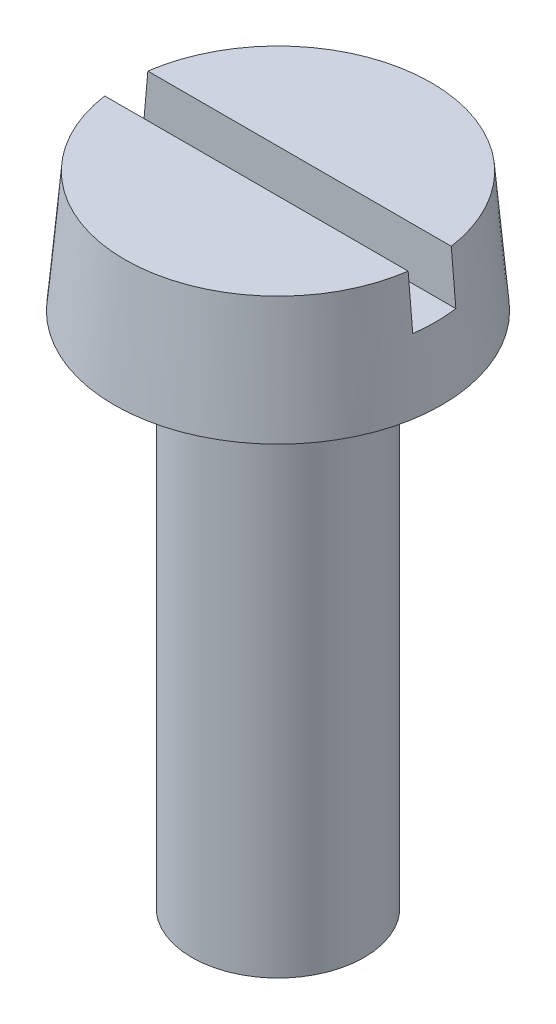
ISO-10303-21;
HEADER;
FILE_DESCRIPTION(('STEP AP214'),'2;1');
FILE_NAME('part.step','',(''),(''),'','','');
FILE_SCHEMA(('AUTOMOTIVE_DESIGN { 1 0 10303 214 1 1 1 1 }'));
ENDSEC;
DATA;
#1=APPLICATION_CONTEXT('core data for automotive mechanical design processes');
#2=APPLICATION_PROTOCOL_DEFINITION('international standard','automotive_design',2000,#1);
#3=PRODUCT_CONTEXT('',#1,'mechanical');
#4=PRODUCT('Part','Part','',(#3));
#5=PRODUCT_RELATED_PRODUCT_CATEGORY('part','',(#4));
#6=PRODUCT_DEFINITION_FORMATION('','',#4);
#7=PRODUCT_DEFINITION_CONTEXT('part definition',#1,'design');
#8=PRODUCT_DEFINITION('design','',#6,#7);
#9=PRODUCT_DEFINITION_SHAPE('','',#8);
#10=(LENGTH_UNIT() NAMED_UNIT(*) SI_UNIT(.MILLI.,.METRE.));
#11=(NAMED_UNIT(*) PLANE_ANGLE_UNIT() SI_UNIT($,.RADIAN.));
#12=(NAMED_UNIT(*) SI_UNIT($,.STERADIAN.) SOLID_ANGLE_UNIT());
#13=UNCERTAINTY_MEASURE_WITH_UNIT(LENGTH_MEASURE(1.E-05),#10,'distance_accuracy_value','');
#14=(GEOMETRIC_REPRESENTATION_CONTEXT(3) GLOBAL_UNCERTAINTY_ASSIGNED_CONTEXT((#13)) GLOBAL_UNIT_ASSIGNED_CONTEXT((#10,
#11,#12)) REPRESENTATION_CONTEXT('',''));
#15=CARTESIAN_POINT('',(0.,0.,0.));
#16=DIRECTION('',(0.,0.,1.));
#17=DIRECTION('',(1.,0.,0.));
#18=AXIS2_PLACEMENT_3D('',#15,#16,#17);
#19=CARTESIAN_POINT('',(2.28,0.800000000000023,0.249999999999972));
#20=DIRECTION('',(0.,-1.,0.));
#21=DIRECTION('',(1.,0.,0.));
#22=AXIS2_PLACEMENT_3D('',#19,#20,#21);
#23=PLANE('',#22);
#24=CARTESIAN_POINT('',(0.,0.800000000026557,0.));
#25=DIRECTION('',(0.,-1.,0.));
#26=DIRECTION('',(1.,0.,0.));
#27=AXIS2_PLACEMENT_3D('',#24,#25,#26);
#28=CIRCLE('',#27,1.83000906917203);
#29=CARTESIAN_POINT('',(-1.81285222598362,0.800000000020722,0.249999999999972));
#30=VERTEX_POINT('',#29);
#31=CARTESIAN_POINT('',(-1.81285222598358,0.800000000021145,-0.249999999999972));
#32=VERTEX_POINT('',#31);
#33=EDGE_CURVE('E70',#30,#32,#28,.T.);
#34=ORIENTED_EDGE('',*,*,#33,.F.);
#35=DIRECTION('',(1.,0.,0.));
#36=VECTOR('',#35,1.);
#37=CARTESIAN_POINT('',(2.28,0.800000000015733,0.249999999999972));
#38=LINE('',#37,#36);
#39=CARTESIAN_POINT('',(1.81285222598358,0.800000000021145,0.249999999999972));
#40=VERTEX_POINT('',#39);
#41=EDGE_CURVE('E68',#30,#40,#38,.T.);
#42=ORIENTED_EDGE('',*,*,#41,.T.);
#43=CARTESIAN_POINT('',(0.,0.800000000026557,0.));
#44=DIRECTION('',(0.,-1.,0.));
#45=DIRECTION('',(1.,0.,0.));
#46=AXIS2_PLACEMENT_3D('',#43,#44,#45);
#47=CIRCLE('',#46,1.83000906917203);
#48=CARTESIAN_POINT('',(1.81285222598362,0.800000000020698,-0.249999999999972));
#49=VERTEX_POINT('',#48);
#50=EDGE_CURVE('E19',#49,#40,#47,.T.);
#51=ORIENTED_EDGE('',*,*,#50,.F.);
#52=DIRECTION('',(-1.,0.,0.));
#53=VECTOR('',#52,1.);
#54=CARTESIAN_POINT('',(2.28,0.800000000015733,-0.249999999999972));
#55=LINE('',#54,#53);
#56=EDGE_CURVE('E63',#49,#32,#55,.T.);
#57=ORIENTED_EDGE('',*,*,#56,.T.);
#58=EDGE_LOOP('',(#34,#42,#51,#57));
#59=FACE_BOUND('',#58,.T.);
#60=ADVANCED_FACE('F16',(#59),#23,.F.);
#61=CARTESIAN_POINT('',(2.28,1.40000000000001,0.249999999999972));
#62=DIRECTION('',(0.,0.,1.));
#63=DIRECTION('',(1.,0.,0.));
#64=AXIS2_PLACEMENT_3D('',#61,#62,#63);
#65=PLANE('',#64);
#66=DIRECTION('',(1.,0.,0.));
#67=VECTOR('',#66,1.);
#68=CARTESIAN_POINT('',(0.,1.40000000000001,0.249999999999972));
#69=LINE('',#68,#67);
#70=CARTESIAN_POINT('',(-1.75984734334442,1.39999999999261,0.249999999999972));
#71=VERTEX_POINT('',#70);
#72=CARTESIAN_POINT('',(1.75984734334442,1.39999999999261,0.249999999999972));
#73=VERTEX_POINT('',#72);
#74=EDGE_CURVE('E72',#71,#73,#69,.T.);
#75=ORIENTED_EDGE('',*,*,#74,.T.);
#76=CARTESIAN_POINT('',(1.81285222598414,0.800000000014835,0.249999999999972));
#77=CARTESIAN_POINT('',(1.80402057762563,0.900000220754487,0.249999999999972));
#78=CARTESIAN_POINT('',(1.79518767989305,1.0000003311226,0.249999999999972));
#79=CARTESIAN_POINT('',(1.77751938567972,1.20000033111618,0.249999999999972));
#80=CARTESIAN_POINT('',(1.76868398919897,1.30000022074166,0.249999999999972));
#81=CARTESIAN_POINT('',(1.75984734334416,1.3999999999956,0.249999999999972));
#82=B_SPLINE_CURVE_WITH_KNOTS('',3,(#76,#77,#78,#79,#80,#81),.UNSPECIFIED.,.F.,.F.,(4,2,4),(0.,
0.301168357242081,0.60233671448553),.UNSPECIFIED.);
#83=EDGE_CURVE('E79',#40,#73,#82,.T.);
#84=ORIENTED_EDGE('',*,*,#83,.F.);
#85=ORIENTED_EDGE('',*,*,#41,.F.);
#86=CARTESIAN_POINT('',(-1.75984734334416,1.3999999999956,0.249999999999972));
#87=CARTESIAN_POINT('',(-1.76868398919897,1.30000022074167,0.249999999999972));
#88=CARTESIAN_POINT('',(-1.77751938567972,1.2000003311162,0.249999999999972));
#89=CARTESIAN_POINT('',(-1.79518767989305,1.00000033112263,0.249999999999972));
#90=CARTESIAN_POINT('',(-1.80402057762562,0.90000022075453,0.249999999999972));
#91=CARTESIAN_POINT('',(-1.81285222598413,0.800000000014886,0.249999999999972));
#92=B_SPLINE_CURVE_WITH_KNOTS('',3,(#86,#87,#88,#89,#90,#91),.UNSPECIFIED.,.F.,.F.,(4,2,4),(0.,
0.301168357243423,0.602336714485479),.UNSPECIFIED.);
#93=EDGE_CURVE('E110',#71,#30,#92,.T.);
#94=ORIENTED_EDGE('',*,*,#93,.F.);
#95=EDGE_LOOP('',(#75,#84,#85,#94));
#96=FACE_BOUND('',#95,.T.);
#97=ADVANCED_FACE('F119',(#96),#65,.F.);
#98=CARTESIAN_POINT('',(2.28,0.800000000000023,-0.249999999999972));
#99=DIRECTION('',(0.,0.,-1.));
#100=DIRECTION('',(-1.,0.,0.));
#101=AXIS2_PLACEMENT_3D('',#98,#99,#100);
#102=PLANE('',#101);
#103=CARTESIAN_POINT('',(1.75984734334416,1.3999999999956,-0.249999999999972));
#104=CARTESIAN_POINT('',(1.76868398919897,1.30000022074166,-0.249999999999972));
#105=CARTESIAN_POINT('',(1.77751938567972,1.20000033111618,-0.249999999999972));
#106=CARTESIAN_POINT('',(1.79518767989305,1.0000003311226,-0.249999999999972));
#107=CARTESIAN_POINT('',(1.80402057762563,0.900000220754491,-0.249999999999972));
#108=CARTESIAN_POINT('',(1.81285222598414,0.800000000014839,-0.249999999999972));
#109=B_SPLINE_CURVE_WITH_KNOTS('',3,(#103,#104,#105,#106,#107,#108),.UNSPECIFIED.,.F.,.F.,(4,2,
4),(0.,0.301168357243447,0.602336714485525),.UNSPECIFIED.);
#110=CARTESIAN_POINT('',(1.75984734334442,1.39999999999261,-0.249999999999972));
#111=VERTEX_POINT('',#110);
#112=EDGE_CURVE('E52',#111,#49,#109,.T.);
#113=ORIENTED_EDGE('',*,*,#112,.F.);
#114=DIRECTION('',(1.,0.,0.));
#115=VECTOR('',#114,1.);
#116=CARTESIAN_POINT('',(0.,1.40000000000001,-0.249999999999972));
#117=LINE('',#116,#115);
#118=CARTESIAN_POINT('',(-1.75984734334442,1.39999999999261,-0.249999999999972));
#119=VERTEX_POINT('',#118);
#120=EDGE_CURVE('E75',#111,#119,#117,.F.);
#121=ORIENTED_EDGE('',*,*,#120,.T.);
#122=CARTESIAN_POINT('',(-1.81285222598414,0.800000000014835,-0.249999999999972));
#123=CARTESIAN_POINT('',(-1.80402057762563,0.900000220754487,-0.249999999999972));
#124=CARTESIAN_POINT('',(-1.79518767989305,1.0000003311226,-0.249999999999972));
#125=CARTESIAN_POINT('',(-1.77751938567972,1.20000033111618,-0.249999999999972));
#126=CARTESIAN_POINT('',(-1.76868398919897,1.30000022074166,-0.249999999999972));
#127=CARTESIAN_POINT('',(-1.75984734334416,1.3999999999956,-0.249999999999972));
#128=B_SPLINE_CURVE_WITH_KNOTS('',3,(#122,#123,#124,#125,#126,#127),.UNSPECIFIED.,.F.,.F.,(4,2,
4),(0.,0.301168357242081,0.60233671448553),.UNSPECIFIED.);
#129=EDGE_CURVE('E34',#32,#119,#128,.T.);
#130=ORIENTED_EDGE('',*,*,#129,.F.);
#131=ORIENTED_EDGE('',*,*,#56,.F.);
#132=EDGE_LOOP('',(#113,#121,#130,#131));
#133=FACE_BOUND('',#132,.T.);
#134=ADVANCED_FACE('F71',(#133),#102,.F.);
#135=CARTESIAN_POINT('',(0.,1.40000000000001,0.));
#136=DIRECTION('',(0.,-1.,0.));
#137=DIRECTION('',(1.,0.,0.));
#138=AXIS2_PLACEMENT_3D('',#135,#136,#137);
#139=PLANE('',#138);
#140=CARTESIAN_POINT('',(0.,1.39999999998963,0.));
#141=DIRECTION('',(0.,-1.,0.));
#142=DIRECTION('',(1.,0.,0.));
#143=AXIS2_PLACEMENT_3D('',#140,#141,#142);
#144=CIRCLE('',#143,1.77751587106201);
#145=EDGE_CURVE('E87',#73,#71,#144,.T.);
#146=ORIENTED_EDGE('',*,*,#145,.F.);
#147=ORIENTED_EDGE('',*,*,#74,.F.);
#148=EDGE_LOOP('',(#146,#147));
#149=FACE_BOUND('',#148,.T.);
#150=ADVANCED_FACE('F129',(#149),#139,.F.);
#151=CARTESIAN_POINT('',(0.,1.40000000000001,0.));
#152=DIRECTION('',(0.,-1.,0.));
#153=DIRECTION('',(1.,0.,0.));
#154=AXIS2_PLACEMENT_3D('',#151,#152,#153);
#155=PLANE('',#154);
#156=ORIENTED_EDGE('',*,*,#120,.F.);
#157=CARTESIAN_POINT('',(0.,1.39999999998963,0.));
#158=DIRECTION('',(0.,-1.,0.));
#159=DIRECTION('',(1.,0.,0.));
#160=AXIS2_PLACEMENT_3D('',#157,#158,#159);
#161=CIRCLE('',#160,1.77751587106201);
#162=EDGE_CURVE('E59',#119,#111,#161,.T.);
#163=ORIENTED_EDGE('',*,*,#162,.F.);
#164=EDGE_LOOP('',(#156,#163));
#165=FACE_BOUND('',#164,.T.);
#166=ADVANCED_FACE('F106',(#165),#155,.F.);
#167=CARTESIAN_POINT('',(0.,0.,0.));
#168=DIRECTION('',(0.,-1.,0.));
#169=DIRECTION('',(1.,0.,0.));
#170=AXIS2_PLACEMENT_3D('',#167,#168,#169);
#171=CONICAL_SURFACE('',#170,1.89999999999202,0.0872664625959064);
#172=ORIENTED_EDGE('',*,*,#83,.T.);
#173=ORIENTED_EDGE('',*,*,#145,.T.);
#174=ORIENTED_EDGE('',*,*,#93,.T.);
#175=ORIENTED_EDGE('',*,*,#33,.T.);
#176=ORIENTED_EDGE('',*,*,#129,.T.);
#177=ORIENTED_EDGE('',*,*,#162,.T.);
#178=ORIENTED_EDGE('',*,*,#112,.T.);
#179=ORIENTED_EDGE('',*,*,#50,.T.);
#180=EDGE_LOOP('',(#172,#173,#174,#175,#176,#177,#178,#179));
#181=FACE_BOUND('',#180,.T.);
#182=CARTESIAN_POINT('',(0.,0.,0.));
#183=DIRECTION('',(0.,-1.,0.));
#184=DIRECTION('',(1.,0.,0.));
#185=AXIS2_PLACEMENT_3D('',#182,#183,#184);
#186=CIRCLE('',#185,1.89999999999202);
#187=CARTESIAN_POINT('',(1.89999999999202,0.,0.));
#188=VERTEX_POINT('',#187);
#189=EDGE_CURVE('E83',#188,#188,#186,.T.);
#190=ORIENTED_EDGE('',*,*,#189,.F.);
#191=EDGE_LOOP('',(#190));
#192=FACE_BOUND('',#191,.T.);
#193=ADVANCED_FACE('F55',(#181,#192),#171,.T.);
#194=CARTESIAN_POINT('',(0.,0.,0.));
#195=DIRECTION('',(0.,-1.,0.));
#196=DIRECTION('',(1.,0.,0.));
#197=AXIS2_PLACEMENT_3D('',#194,#195,#196);
#198=PLANE('',#197);
#199=ORIENTED_EDGE('',*,*,#189,.T.);
#200=EDGE_LOOP('',(#199));
#201=FACE_BOUND('',#200,.T.);
#202=CARTESIAN_POINT('',(0.,0.,0.));
#203=DIRECTION('',(0.,-1.,0.));
#204=DIRECTION('',(1.,0.,0.));
#205=AXIS2_PLACEMENT_3D('',#202,#203,#204);
#206=CIRCLE('',#205,1.);
#207=CARTESIAN_POINT('',(1.,0.,0.));
#208=VERTEX_POINT('',#207);
#209=EDGE_CURVE('E25',#208,#208,#206,.T.);
#210=ORIENTED_EDGE('',*,*,#209,.F.);
#211=EDGE_LOOP('',(#210));
#212=FACE_BOUND('',#211,.T.);
#213=ADVANCED_FACE('F105',(#201,#212),#198,.T.);
#214=CARTESIAN_POINT('',(0.,-6.00000000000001,0.));
#215=DIRECTION('',(0.,-1.,0.));
#216=DIRECTION('',(1.,0.,0.));
#217=AXIS2_PLACEMENT_3D('',#214,#215,#216);
#218=PLANE('',#217);
#219=CARTESIAN_POINT('',(0.,-6.00000000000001,0.));
#220=DIRECTION('',(0.,-1.,0.));
#221=DIRECTION('',(1.,0.,0.));
#222=AXIS2_PLACEMENT_3D('',#219,#220,#221);
#223=CIRCLE('',#222,1.);
#224=CARTESIAN_POINT('',(1.,-6.00000000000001,0.));
#225=VERTEX_POINT('',#224);
#226=EDGE_CURVE('E11',#225,#225,#223,.F.);
#227=ORIENTED_EDGE('',*,*,#226,.F.);
#228=EDGE_LOOP('',(#227));
#229=FACE_BOUND('',#228,.T.);
#230=ADVANCED_FACE('F132',(#229),#218,.T.);
#231=CARTESIAN_POINT('',(0.,1.76999999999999,0.));
#232=DIRECTION('',(0.,-1.,0.));
#233=DIRECTION('',(1.,0.,0.));
#234=AXIS2_PLACEMENT_3D('',#231,#232,#233);
#235=CYLINDRICAL_SURFACE('',#234,1.);
#236=ORIENTED_EDGE('',*,*,#226,.T.);
#237=EDGE_LOOP('',(#236));
#238=FACE_BOUND('',#237,.T.);
#239=ORIENTED_EDGE('',*,*,#209,.T.);
#240=EDGE_LOOP('',(#239));
#241=FACE_BOUND('',#240,.T.);
#242=ADVANCED_FACE('F130',(#238,#241),#235,.T.);
#243=CLOSED_SHELL('',(#60,#97,#134,#150,#166,#193,#213,#230,#242));
#244=MANIFOLD_SOLID_BREP('B1',#243);
#245=ADVANCED_BREP_SHAPE_REPRESENTATION('',(#18,#244),#14);
#246=SHAPE_DEFINITION_REPRESENTATION(#9,#245);
ENDSEC;
END-ISO-10303-21;
